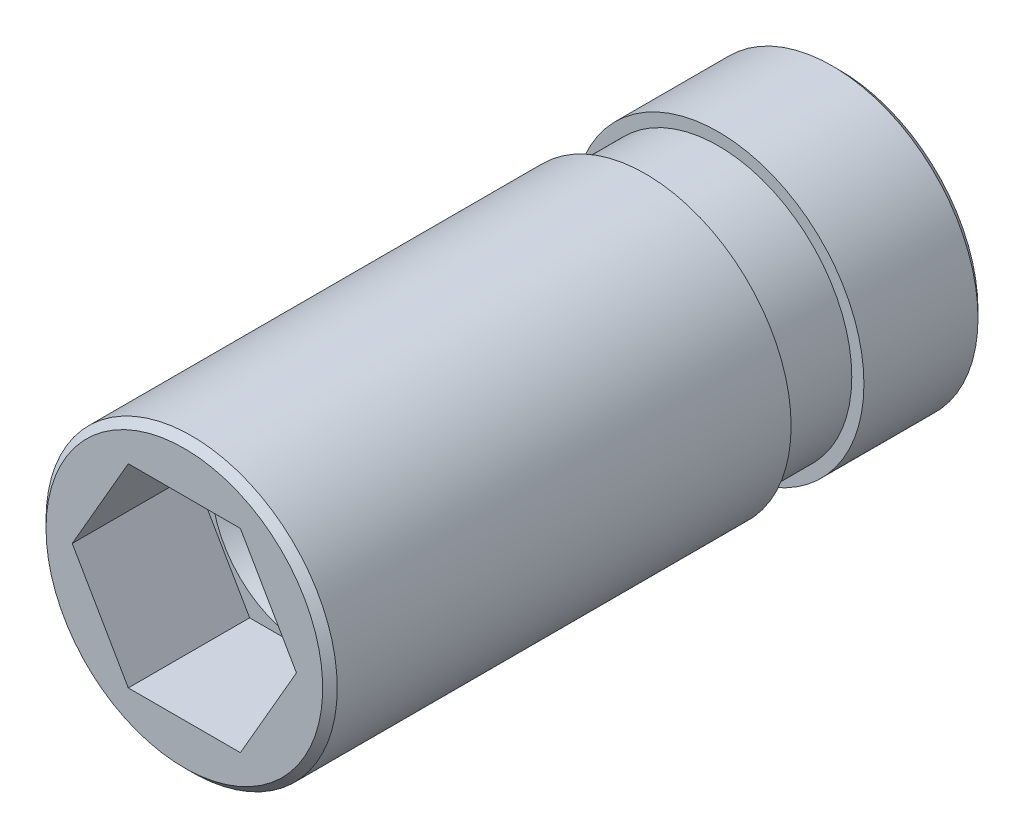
ISO-10303-21;
HEADER;
FILE_DESCRIPTION(('STEP AP214'),'2;1');
FILE_NAME('part.step','',(''),(''),'','','');
FILE_SCHEMA(('AUTOMOTIVE_DESIGN { 1 0 10303 214 1 1 1 1 }'));
ENDSEC;
DATA;
#1=APPLICATION_CONTEXT('core data for automotive mechanical design processes');
#2=APPLICATION_PROTOCOL_DEFINITION('international standard','automotive_design',2000,#1);
#3=PRODUCT_CONTEXT('',#1,'mechanical');
#4=PRODUCT('Part','Part','',(#3));
#5=PRODUCT_RELATED_PRODUCT_CATEGORY('part','',(#4));
#6=PRODUCT_DEFINITION_FORMATION('','',#4);
#7=PRODUCT_DEFINITION_CONTEXT('part definition',#1,'design');
#8=PRODUCT_DEFINITION('design','',#6,#7);
#9=PRODUCT_DEFINITION_SHAPE('','',#8);
#10=(LENGTH_UNIT() NAMED_UNIT(*) SI_UNIT(.MILLI.,.METRE.));
#11=(NAMED_UNIT(*) PLANE_ANGLE_UNIT() SI_UNIT($,.RADIAN.));
#12=(NAMED_UNIT(*) SI_UNIT($,.STERADIAN.) SOLID_ANGLE_UNIT());
#13=UNCERTAINTY_MEASURE_WITH_UNIT(LENGTH_MEASURE(1.E-05),#10,'distance_accuracy_value','');
#14=(GEOMETRIC_REPRESENTATION_CONTEXT(3) GLOBAL_UNCERTAINTY_ASSIGNED_CONTEXT((#13)) GLOBAL_UNIT_ASSIGNED_CONTEXT((#10,
#11,#12)) REPRESENTATION_CONTEXT('',''));
#15=CARTESIAN_POINT('',(0.,0.,0.));
#16=DIRECTION('',(0.,0.,1.));
#17=DIRECTION('',(1.,0.,0.));
#18=AXIS2_PLACEMENT_3D('',#15,#16,#17);
#19=CARTESIAN_POINT('',(0.,5.99999999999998,-26.9999999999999));
#20=DIRECTION('',(0.,0.,1.));
#21=DIRECTION('',(1.,0.,0.));
#22=AXIS2_PLACEMENT_3D('',#19,#20,#21);
#23=PLANE('',#22);
#24=CARTESIAN_POINT('',(0.,-1.38777878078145E-13,-27.));
#25=DIRECTION('',(0.,0.,1.));
#26=DIRECTION('',(1.,0.,0.));
#27=AXIS2_PLACEMENT_3D('',#24,#25,#26);
#28=CIRCLE('',#27,3.87500000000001);
#29=CARTESIAN_POINT('',(3.8750000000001,-1.32502105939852E-13,-27.));
#30=VERTEX_POINT('',#29);
#31=EDGE_CURVE('E13',#30,#30,#28,.T.);
#32=ORIENTED_EDGE('',*,*,#31,.T.);
#33=EDGE_LOOP('',(#32));
#34=FACE_BOUND('',#33,.T.);
#35=CARTESIAN_POINT('',(0.,-1.38777878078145E-13,-27.));
#36=DIRECTION('',(0.,0.,1.));
#37=DIRECTION('',(1.,0.,0.));
#38=AXIS2_PLACEMENT_3D('',#35,#36,#37);
#39=CIRCLE('',#38,5.7);
#40=CARTESIAN_POINT('',(5.70000000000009,-1.29546419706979E-13,-27.));
#41=VERTEX_POINT('',#40);
#42=EDGE_CURVE('E164',#41,#41,#39,.F.);
#43=ORIENTED_EDGE('',*,*,#42,.T.);
#44=EDGE_LOOP('',(#43));
#45=FACE_BOUND('',#44,.T.);
#46=ADVANCED_FACE('F36',(#34,#45),#23,.F.);
#47=CARTESIAN_POINT('',(1.52655665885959E-13,-1.66533453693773E-13,40.));
#48=DIRECTION('',(0.,0.,1.));
#49=DIRECTION('',(1.,0.,0.));
#50=AXIS2_PLACEMENT_3D('',#47,#48,#49);
#51=CYLINDRICAL_SURFACE('',#50,6.);
#52=CARTESIAN_POINT('',(0.,-1.38777878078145E-13,-26.7));
#53=DIRECTION('',(0.,0.,1.));
#54=DIRECTION('',(1.,0.,0.));
#55=AXIS2_PLACEMENT_3D('',#52,#53,#54);
#56=CIRCLE('',#55,6.);
#57=CARTESIAN_POINT('',(6.00000000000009,-1.29060553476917E-13,-26.7));
#58=VERTEX_POINT('',#57);
#59=EDGE_CURVE('E161',#58,#58,#56,.T.);
#60=ORIENTED_EDGE('',*,*,#59,.T.);
#61=EDGE_LOOP('',(#60));
#62=FACE_BOUND('',#61,.T.);
#63=CARTESIAN_POINT('',(1.11022302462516E-13,0.,-22.));
#64=DIRECTION('',(0.,0.,1.));
#65=DIRECTION('',(1.,0.,0.));
#66=AXIS2_PLACEMENT_3D('',#63,#64,#65);
#67=CIRCLE('',#66,6.);
#68=CARTESIAN_POINT('',(6.00000000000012,0.,-22.));
#69=VERTEX_POINT('',#68);
#70=EDGE_CURVE('E152',#69,#69,#67,.T.);
#71=ORIENTED_EDGE('',*,*,#70,.F.);
#72=EDGE_LOOP('',(#71));
#73=FACE_BOUND('',#72,.T.);
#74=ADVANCED_FACE('F199',(#62,#73),#51,.T.);
#75=CARTESIAN_POINT('',(0.,5.49999999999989,-21.9999999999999));
#76=DIRECTION('',(0.,0.,-1.));
#77=DIRECTION('',(-1.,0.,0.));
#78=AXIS2_PLACEMENT_3D('',#75,#76,#77);
#79=PLANE('',#78);
#80=CARTESIAN_POINT('',(1.11022302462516E-13,0.,-22.));
#81=DIRECTION('',(0.,0.,1.));
#82=DIRECTION('',(1.,0.,0.));
#83=AXIS2_PLACEMENT_3D('',#80,#81,#82);
#84=CIRCLE('',#83,5.5);
#85=CARTESIAN_POINT('',(5.50000000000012,0.,-22.));
#86=VERTEX_POINT('',#85);
#87=EDGE_CURVE('E149',#86,#86,#84,.T.);
#88=ORIENTED_EDGE('',*,*,#87,.F.);
#89=EDGE_LOOP('',(#88));
#90=FACE_BOUND('',#89,.T.);
#91=ORIENTED_EDGE('',*,*,#70,.T.);
#92=EDGE_LOOP('',(#91));
#93=FACE_BOUND('',#92,.T.);
#94=ADVANCED_FACE('F210',(#90,#93),#79,.F.);
#95=CARTESIAN_POINT('',(1.52655665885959E-13,-1.66533453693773E-13,40.));
#96=DIRECTION('',(0.,0.,1.));
#97=DIRECTION('',(1.,0.,0.));
#98=AXIS2_PLACEMENT_3D('',#95,#96,#97);
#99=CYLINDRICAL_SURFACE('',#98,5.5);
#100=CARTESIAN_POINT('',(1.04083408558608E-13,-1.11022302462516E-13,-19.));
#101=DIRECTION('',(0.,0.,1.));
#102=DIRECTION('',(1.,0.,0.));
#103=AXIS2_PLACEMENT_3D('',#100,#101,#102);
#104=CIRCLE('',#103,5.5);
#105=CARTESIAN_POINT('',(5.50000000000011,-1.02114754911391E-13,-19.));
#106=VERTEX_POINT('',#105);
#107=EDGE_CURVE('E146',#106,#106,#104,.T.);
#108=ORIENTED_EDGE('',*,*,#107,.F.);
#109=EDGE_LOOP('',(#108));
#110=FACE_BOUND('',#109,.T.);
#111=ORIENTED_EDGE('',*,*,#87,.T.);
#112=EDGE_LOOP('',(#111));
#113=FACE_BOUND('',#112,.T.);
#114=ADVANCED_FACE('F214',(#110,#113),#99,.T.);
#115=CARTESIAN_POINT('',(0.,5.99999999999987,-18.9999999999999));
#116=DIRECTION('',(0.,0.,1.));
#117=DIRECTION('',(1.,0.,0.));
#118=AXIS2_PLACEMENT_3D('',#115,#116,#117);
#119=PLANE('',#118);
#120=CARTESIAN_POINT('',(1.04083408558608E-13,-1.11022302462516E-13,-19.));
#121=DIRECTION('',(0.,0.,1.));
#122=DIRECTION('',(1.,0.,0.));
#123=AXIS2_PLACEMENT_3D('',#120,#121,#122);
#124=CIRCLE('',#123,6.);
#125=CARTESIAN_POINT('',(6.00000000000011,-1.01304977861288E-13,-19.));
#126=VERTEX_POINT('',#125);
#127=EDGE_CURVE('E137',#126,#126,#124,.T.);
#128=ORIENTED_EDGE('',*,*,#127,.F.);
#129=EDGE_LOOP('',(#128));
#130=FACE_BOUND('',#129,.T.);
#131=ORIENTED_EDGE('',*,*,#107,.T.);
#132=EDGE_LOOP('',(#131));
#133=FACE_BOUND('',#132,.T.);
#134=ADVANCED_FACE('F220',(#130,#133),#119,.F.);
#135=CARTESIAN_POINT('',(1.52655665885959E-13,-1.66533453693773E-13,40.));
#136=DIRECTION('',(0.,0.,1.));
#137=DIRECTION('',(1.,0.,0.));
#138=AXIS2_PLACEMENT_3D('',#135,#136,#137);
#139=CYLINDRICAL_SURFACE('',#138,6.);
#140=CARTESIAN_POINT('',(0.,0.,-0.300000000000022));
#141=DIRECTION('',(0.,0.,-1.));
#142=DIRECTION('',(-1.,0.,0.));
#143=AXIS2_PLACEMENT_3D('',#140,#141,#142);
#144=CIRCLE('',#143,6.);
#145=CARTESIAN_POINT('',(-5.99999999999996,0.,-0.300000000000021));
#146=VERTEX_POINT('',#145);
#147=EDGE_CURVE('E158',#146,#146,#144,.T.);
#148=ORIENTED_EDGE('',*,*,#147,.T.);
#149=EDGE_LOOP('',(#148));
#150=FACE_BOUND('',#149,.T.);
#151=ORIENTED_EDGE('',*,*,#127,.T.);
#152=EDGE_LOOP('',(#151));
#153=FACE_BOUND('',#152,.T.);
#154=ADVANCED_FACE('F227',(#150,#153),#139,.T.);
#155=CARTESIAN_POINT('',(1.17961196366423E-13,-1.38777878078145E-13,0.));
#156=DIRECTION('',(0.,0.,-1.));
#157=DIRECTION('',(-1.,0.,0.));
#158=AXIS2_PLACEMENT_3D('',#155,#156,#157);
#159=PLANE('',#158);
#160=CARTESIAN_POINT('',(1.17961196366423E-13,-1.38777878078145E-13,0.));
#161=DIRECTION('',(0.,0.,-1.));
#162=DIRECTION('',(-1.,0.,0.));
#163=AXIS2_PLACEMENT_3D('',#160,#161,#162);
#164=CIRCLE('',#163,5.69999999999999);
#165=CARTESIAN_POINT('',(-5.69999999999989,-1.4800933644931E-13,0.));
#166=VERTEX_POINT('',#165);
#167=EDGE_CURVE('E155',#166,#166,#164,.F.);
#168=ORIENTED_EDGE('',*,*,#167,.T.);
#169=EDGE_LOOP('',(#168));
#170=FACE_BOUND('',#169,.T.);
#171=DIRECTION('',(0.500000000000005,-0.866025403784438,0.));
#172=VECTOR('',#171,1.);
#173=CARTESIAN_POINT('',(-4.61880215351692,0.,-2.77555756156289E-13));
#174=LINE('',#173,#172);
#175=CARTESIAN_POINT('',(-4.61880215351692,0.,-2.77555756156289E-13));
#176=VERTEX_POINT('',#175);
#177=CARTESIAN_POINT('',(-2.30940107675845,-3.99999999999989,-5.55111512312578E-13));
#178=VERTEX_POINT('',#177);
#179=EDGE_CURVE('E104',#176,#178,#174,.T.);
#180=ORIENTED_EDGE('',*,*,#179,.F.);
#181=DIRECTION('',(-0.499999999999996,-0.866025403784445,0.));
#182=VECTOR('',#181,1.);
#183=CARTESIAN_POINT('',(-2.30940107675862,3.99999999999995,0.));
#184=LINE('',#183,#182);
#185=CARTESIAN_POINT('',(-2.30940107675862,3.99999999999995,0.));
#186=VERTEX_POINT('',#185);
#187=EDGE_CURVE('E50',#186,#176,#184,.T.);
#188=ORIENTED_EDGE('',*,*,#187,.F.);
#189=DIRECTION('',(-1.,0.,0.));
#190=VECTOR('',#189,1.);
#191=CARTESIAN_POINT('',(2.30940107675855,3.99999999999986,0.));
#192=LINE('',#191,#190);
#193=CARTESIAN_POINT('',(2.30940107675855,3.99999999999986,0.));
#194=VERTEX_POINT('',#193);
#195=EDGE_CURVE('E119',#194,#186,#192,.T.);
#196=ORIENTED_EDGE('',*,*,#195,.F.);
#197=DIRECTION('',(-0.500000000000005,0.866025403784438,0.));
#198=VECTOR('',#197,1.);
#199=CARTESIAN_POINT('',(4.61880215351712,0.,-1.66533453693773E-13));
#200=LINE('',#199,#198);
#201=CARTESIAN_POINT('',(4.61880215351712,0.,-1.66533453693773E-13));
#202=VERTEX_POINT('',#201);
#203=EDGE_CURVE('E113',#202,#194,#200,.T.);
#204=ORIENTED_EDGE('',*,*,#203,.F.);
#205=DIRECTION('',(0.499999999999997,0.866025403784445,0.));
#206=VECTOR('',#205,1.);
#207=CARTESIAN_POINT('',(2.30940107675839,-4.00000000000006,-2.77555756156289E-13));
#208=LINE('',#207,#206);
#209=CARTESIAN_POINT('',(2.30940107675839,-4.00000000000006,-2.77555756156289E-13));
#210=VERTEX_POINT('',#209);
#211=EDGE_CURVE('E111',#210,#202,#208,.T.);
#212=ORIENTED_EDGE('',*,*,#211,.F.);
#213=DIRECTION('',(1.,0.,0.));
#214=VECTOR('',#213,1.);
#215=CARTESIAN_POINT('',(-2.30940107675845,-3.99999999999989,-5.55111512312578E-13));
#216=LINE('',#215,#214);
#217=EDGE_CURVE('E93',#178,#210,#216,.T.);
#218=ORIENTED_EDGE('',*,*,#217,.F.);
#219=EDGE_LOOP('',(#180,#188,#196,#204,#212,#218));
#220=FACE_BOUND('',#219,.T.);
#221=ADVANCED_FACE('F108',(#170,#220),#159,.F.);
#222=CARTESIAN_POINT('',(-2.30940107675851,3.99999999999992,-4.99999999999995));
#223=DIRECTION('',(-0.866025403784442,0.499999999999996,0.));
#224=DIRECTION('',(-0.499999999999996,-0.866025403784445,0.));
#225=AXIS2_PLACEMENT_3D('',#222,#223,#224);
#226=PLANE('',#225);
#227=ORIENTED_EDGE('',*,*,#187,.T.);
#228=DIRECTION('',(0.,0.,1.));
#229=VECTOR('',#228,1.);
#230=CARTESIAN_POINT('',(-4.61880215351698,0.,-5.00000000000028));
#231=LINE('',#230,#229);
#232=CARTESIAN_POINT('',(-4.61880215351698,0.,-5.00000000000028));
#233=VERTEX_POINT('',#232);
#234=EDGE_CURVE('E101',#233,#176,#231,.T.);
#235=ORIENTED_EDGE('',*,*,#234,.F.);
#236=DIRECTION('',(-0.499999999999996,-0.866025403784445,0.));
#237=VECTOR('',#236,1.);
#238=CARTESIAN_POINT('',(-2.30940107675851,3.99999999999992,-4.99999999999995));
#239=LINE('',#238,#237);
#240=CARTESIAN_POINT('',(-2.30940107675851,3.99999999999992,-4.99999999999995));
#241=VERTEX_POINT('',#240);
#242=EDGE_CURVE('E121',#241,#233,#239,.T.);
#243=ORIENTED_EDGE('',*,*,#242,.F.);
#244=DIRECTION('',(0.,0.,1.));
#245=VECTOR('',#244,1.);
#246=CARTESIAN_POINT('',(-2.30940107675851,3.99999999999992,-4.99999999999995));
#247=LINE('',#246,#245);
#248=EDGE_CURVE('E57',#241,#186,#247,.T.);
#249=ORIENTED_EDGE('',*,*,#248,.T.);
#250=EDGE_LOOP('',(#227,#235,#243,#249));
#251=FACE_BOUND('',#250,.T.);
#252=ADVANCED_FACE('F234',(#251),#226,.F.);
#253=CARTESIAN_POINT('',(2.3094010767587,4.,-4.99999999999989));
#254=DIRECTION('',(0.,1.,0.));
#255=DIRECTION('',(-1.,0.,0.));
#256=AXIS2_PLACEMENT_3D('',#253,#254,#255);
#257=PLANE('',#256);
#258=ORIENTED_EDGE('',*,*,#195,.T.);
#259=ORIENTED_EDGE('',*,*,#248,.F.);
#260=DIRECTION('',(-1.,0.,0.));
#261=VECTOR('',#260,1.);
#262=CARTESIAN_POINT('',(2.3094010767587,4.,-4.99999999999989));
#263=LINE('',#262,#261);
#264=CARTESIAN_POINT('',(2.3094010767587,4.,-4.99999999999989));
#265=VERTEX_POINT('',#264);
#266=EDGE_CURVE('E133',#265,#241,#263,.T.);
#267=ORIENTED_EDGE('',*,*,#266,.F.);
#268=DIRECTION('',(0.,0.,1.));
#269=VECTOR('',#268,1.);
#270=CARTESIAN_POINT('',(2.3094010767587,4.,-4.99999999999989));
#271=LINE('',#270,#269);
#272=EDGE_CURVE('E138',#265,#194,#271,.T.);
#273=ORIENTED_EDGE('',*,*,#272,.T.);
#274=EDGE_LOOP('',(#258,#259,#267,#273));
#275=FACE_BOUND('',#274,.T.);
#276=ADVANCED_FACE('F238',(#275),#257,.F.);
#277=CARTESIAN_POINT('',(4.61880215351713,0.,-5.00000000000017));
#278=DIRECTION('',(0.866025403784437,0.500000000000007,0.));
#279=DIRECTION('',(-0.500000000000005,0.866025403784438,0.));
#280=AXIS2_PLACEMENT_3D('',#277,#278,#279);
#281=PLANE('',#280);
#282=ORIENTED_EDGE('',*,*,#203,.T.);
#283=ORIENTED_EDGE('',*,*,#272,.F.);
#284=DIRECTION('',(-0.500000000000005,0.866025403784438,0.));
#285=VECTOR('',#284,1.);
#286=CARTESIAN_POINT('',(4.61880215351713,0.,-5.00000000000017));
#287=LINE('',#286,#285);
#288=CARTESIAN_POINT('',(4.61880215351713,0.,-5.00000000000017));
#289=VERTEX_POINT('',#288);
#290=EDGE_CURVE('E130',#289,#265,#287,.T.);
#291=ORIENTED_EDGE('',*,*,#290,.F.);
#292=DIRECTION('',(0.,0.,1.));
#293=VECTOR('',#292,1.);
#294=CARTESIAN_POINT('',(4.61880215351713,0.,-5.00000000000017));
#295=LINE('',#294,#293);
#296=EDGE_CURVE('E140',#289,#202,#295,.T.);
#297=ORIENTED_EDGE('',*,*,#296,.T.);
#298=EDGE_LOOP('',(#282,#283,#291,#297));
#299=FACE_BOUND('',#298,.T.);
#300=ADVANCED_FACE('F246',(#299),#281,.F.);
#301=CARTESIAN_POINT('',(2.30940107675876,-3.99999999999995,-5.00000000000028));
#302=DIRECTION('',(0.866025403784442,-0.499999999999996,0.));
#303=DIRECTION('',(0.499999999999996,0.866025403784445,0.));
#304=AXIS2_PLACEMENT_3D('',#301,#302,#303);
#305=PLANE('',#304);
#306=ORIENTED_EDGE('',*,*,#211,.T.);
#307=ORIENTED_EDGE('',*,*,#296,.F.);
#308=DIRECTION('',(0.499999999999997,0.866025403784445,0.));
#309=VECTOR('',#308,1.);
#310=CARTESIAN_POINT('',(2.30940107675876,-3.99999999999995,-5.00000000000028));
#311=LINE('',#310,#309);
#312=CARTESIAN_POINT('',(2.30940107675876,-3.99999999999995,-5.00000000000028));
#313=VERTEX_POINT('',#312);
#314=EDGE_CURVE('E127',#313,#289,#311,.T.);
#315=ORIENTED_EDGE('',*,*,#314,.F.);
#316=DIRECTION('',(0.,0.,1.));
#317=VECTOR('',#316,1.);
#318=CARTESIAN_POINT('',(2.30940107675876,-3.99999999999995,-5.00000000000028));
#319=LINE('',#318,#317);
#320=EDGE_CURVE('E100',#313,#210,#319,.T.);
#321=ORIENTED_EDGE('',*,*,#320,.T.);
#322=EDGE_LOOP('',(#306,#307,#315,#321));
#323=FACE_BOUND('',#322,.T.);
#324=ADVANCED_FACE('F243',(#323),#305,.F.);
#325=CARTESIAN_POINT('',(-2.30940107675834,-4.00000000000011,-5.00000000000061));
#326=DIRECTION('',(0.,-1.,0.));
#327=DIRECTION('',(1.,0.,0.));
#328=AXIS2_PLACEMENT_3D('',#325,#326,#327);
#329=PLANE('',#328);
#330=ORIENTED_EDGE('',*,*,#217,.T.);
#331=ORIENTED_EDGE('',*,*,#320,.F.);
#332=DIRECTION('',(1.,0.,0.));
#333=VECTOR('',#332,1.);
#334=CARTESIAN_POINT('',(-2.30940107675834,-4.00000000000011,-5.00000000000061));
#335=LINE('',#334,#333);
#336=CARTESIAN_POINT('',(-2.30940107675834,-4.00000000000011,-5.00000000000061));
#337=VERTEX_POINT('',#336);
#338=EDGE_CURVE('E96',#337,#313,#335,.T.);
#339=ORIENTED_EDGE('',*,*,#338,.F.);
#340=DIRECTION('',(0.,0.,1.));
#341=VECTOR('',#340,1.);
#342=CARTESIAN_POINT('',(-2.30940107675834,-4.00000000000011,-5.00000000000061));
#343=LINE('',#342,#341);
#344=EDGE_CURVE('E89',#337,#178,#343,.T.);
#345=ORIENTED_EDGE('',*,*,#344,.T.);
#346=EDGE_LOOP('',(#330,#331,#339,#345));
#347=FACE_BOUND('',#346,.T.);
#348=ADVANCED_FACE('F91',(#347),#329,.F.);
#349=CARTESIAN_POINT('',(-4.61880215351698,0.,-5.00000000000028));
#350=DIRECTION('',(-0.866025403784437,-0.500000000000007,0.));
#351=DIRECTION('',(0.500000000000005,-0.866025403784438,0.));
#352=AXIS2_PLACEMENT_3D('',#349,#350,#351);
#353=PLANE('',#352);
#354=ORIENTED_EDGE('',*,*,#179,.T.);
#355=ORIENTED_EDGE('',*,*,#344,.F.);
#356=DIRECTION('',(0.500000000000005,-0.866025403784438,0.));
#357=VECTOR('',#356,1.);
#358=CARTESIAN_POINT('',(-4.61880215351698,0.,-5.00000000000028));
#359=LINE('',#358,#357);
#360=EDGE_CURVE('E124',#233,#337,#359,.T.);
#361=ORIENTED_EDGE('',*,*,#360,.F.);
#362=ORIENTED_EDGE('',*,*,#234,.T.);
#363=EDGE_LOOP('',(#354,#355,#361,#362));
#364=FACE_BOUND('',#363,.T.);
#365=ADVANCED_FACE('F105',(#364),#353,.F.);
#366=CARTESIAN_POINT('',(1.45716771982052E-13,7.99999999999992,-4.99999999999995));
#367=DIRECTION('',(0.,0.,-1.));
#368=DIRECTION('',(-1.,0.,0.));
#369=AXIS2_PLACEMENT_3D('',#366,#367,#368);
#370=PLANE('',#369);
#371=CARTESIAN_POINT('',(1.73472347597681E-13,0.,-5.));
#372=DIRECTION('',(0.,0.,-1.));
#373=DIRECTION('',(-1.,0.,0.));
#374=AXIS2_PLACEMENT_3D('',#371,#372,#373);
#375=CIRCLE('',#374,3.87500000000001);
#376=CARTESIAN_POINT('',(-3.87499999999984,0.,-5.));
#377=VERTEX_POINT('',#376);
#378=EDGE_CURVE('E43',#377,#377,#375,.T.);
#379=ORIENTED_EDGE('',*,*,#378,.T.);
#380=EDGE_LOOP('',(#379));
#381=FACE_BOUND('',#380,.T.);
#382=ORIENTED_EDGE('',*,*,#242,.T.);
#383=ORIENTED_EDGE('',*,*,#360,.T.);
#384=ORIENTED_EDGE('',*,*,#338,.T.);
#385=ORIENTED_EDGE('',*,*,#314,.T.);
#386=ORIENTED_EDGE('',*,*,#290,.T.);
#387=ORIENTED_EDGE('',*,*,#266,.T.);
#388=EDGE_LOOP('',(#382,#383,#384,#385,#386,#387));
#389=FACE_BOUND('',#388,.T.);
#390=ADVANCED_FACE('F175',(#381,#389),#370,.F.);
#391=CARTESIAN_POINT('',(1.17961196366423E-13,-1.38777878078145E-13,0.));
#392=DIRECTION('',(0.,0.,-1.));
#393=DIRECTION('',(-1.,0.,0.));
#394=AXIS2_PLACEMENT_3D('',#391,#392,#393);
#395=CONICAL_SURFACE('',#394,5.69999999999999,0.785398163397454);
#396=ORIENTED_EDGE('',*,*,#147,.F.);
#397=EDGE_LOOP('',(#396));
#398=FACE_BOUND('',#397,.T.);
#399=ORIENTED_EDGE('',*,*,#167,.F.);
#400=EDGE_LOOP('',(#399));
#401=FACE_BOUND('',#400,.T.);
#402=ADVANCED_FACE('F204',(#398,#401),#395,.T.);
#403=CARTESIAN_POINT('',(0.,-1.38777878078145E-13,-26.7));
#404=DIRECTION('',(0.,0.,1.));
#405=DIRECTION('',(1.,0.,0.));
#406=AXIS2_PLACEMENT_3D('',#403,#404,#405);
#407=CONICAL_SURFACE('',#406,6.,0.785398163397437);
#408=ORIENTED_EDGE('',*,*,#42,.F.);
#409=EDGE_LOOP('',(#408));
#410=FACE_BOUND('',#409,.T.);
#411=ORIENTED_EDGE('',*,*,#59,.F.);
#412=EDGE_LOOP('',(#411));
#413=FACE_BOUND('',#412,.T.);
#414=ADVANCED_FACE('F188',(#410,#413),#407,.T.);
#415=CARTESIAN_POINT('',(0.,-1.38777878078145E-13,-27.));
#416=DIRECTION('',(0.,0.,1.));
#417=DIRECTION('',(1.,0.,0.));
#418=AXIS2_PLACEMENT_3D('',#415,#416,#417);
#419=CYLINDRICAL_SURFACE('',#418,3.375);
#420=CARTESIAN_POINT('',(0.,0.,-5.50000000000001));
#421=DIRECTION('',(0.,0.,-1.));
#422=DIRECTION('',(-1.,0.,0.));
#423=AXIS2_PLACEMENT_3D('',#420,#421,#422);
#424=CIRCLE('',#423,3.375);
#425=CARTESIAN_POINT('',(-3.37499999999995,0.,-5.5));
#426=VERTEX_POINT('',#425);
#427=EDGE_CURVE('E170',#426,#426,#424,.F.);
#428=ORIENTED_EDGE('',*,*,#427,.T.);
#429=EDGE_LOOP('',(#428));
#430=FACE_BOUND('',#429,.T.);
#431=CARTESIAN_POINT('',(1.38777878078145E-13,0.,-26.5));
#432=DIRECTION('',(0.,0.,1.));
#433=DIRECTION('',(1.,0.,0.));
#434=AXIS2_PLACEMENT_3D('',#431,#432,#433);
#435=CIRCLE('',#434,3.375);
#436=CARTESIAN_POINT('',(3.37500000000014,0.,-26.5));
#437=VERTEX_POINT('',#436);
#438=EDGE_CURVE('E167',#437,#437,#435,.F.);
#439=ORIENTED_EDGE('',*,*,#438,.T.);
#440=EDGE_LOOP('',(#439));
#441=FACE_BOUND('',#440,.T.);
#442=ADVANCED_FACE('F182',(#430,#441),#419,.F.);
#443=CARTESIAN_POINT('',(0.,0.,-5.50000000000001));
#444=DIRECTION('',(0.,0.,1.));
#445=DIRECTION('',(1.,0.,0.));
#446=AXIS2_PLACEMENT_3D('',#443,#444,#445);
#447=CONICAL_SURFACE('',#446,3.375,0.785398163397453);
#448=ORIENTED_EDGE('',*,*,#378,.F.);
#449=EDGE_LOOP('',(#448));
#450=FACE_BOUND('',#449,.T.);
#451=ORIENTED_EDGE('',*,*,#427,.F.);
#452=EDGE_LOOP('',(#451));
#453=FACE_BOUND('',#452,.T.);
#454=ADVANCED_FACE('F178',(#450,#453),#447,.F.);
#455=CARTESIAN_POINT('',(0.,-1.38777878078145E-13,-27.));
#456=DIRECTION('',(0.,0.,-1.));
#457=DIRECTION('',(-1.,0.,0.));
#458=AXIS2_PLACEMENT_3D('',#455,#456,#457);
#459=CONICAL_SURFACE('',#458,3.87500000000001,0.785398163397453);
#460=ORIENTED_EDGE('',*,*,#438,.F.);
#461=EDGE_LOOP('',(#460));
#462=FACE_BOUND('',#461,.T.);
#463=ORIENTED_EDGE('',*,*,#31,.F.);
#464=EDGE_LOOP('',(#463));
#465=FACE_BOUND('',#464,.T.);
#466=ADVANCED_FACE('F181',(#462,#465),#459,.F.);
#467=CLOSED_SHELL('',(#46,#74,#94,#114,#134,#154,#221,#252,#276,#300,#324,#348,#365,#390,#402,
#414,#442,#454,#466));
#468=MANIFOLD_SOLID_BREP('B2',#467);
#469=ADVANCED_BREP_SHAPE_REPRESENTATION('',(#18,#468),#14);
#470=SHAPE_DEFINITION_REPRESENTATION(#9,#469);
ENDSEC;
END-ISO-10303-21;
